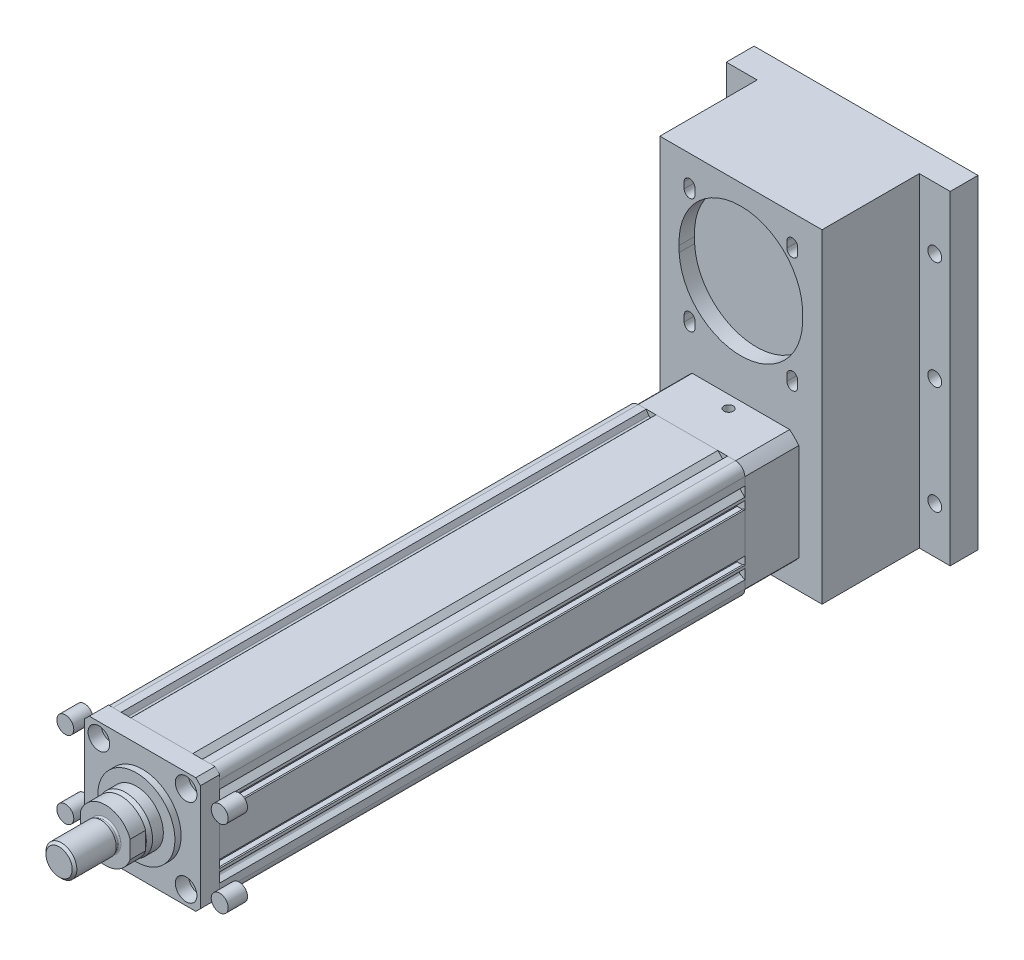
from build123d import *

# Parameters (mm, degrees)
SKETCH_1_R          = 31.5
SKETCH_1_R_2        = 3.35
EXTRUDE_1_DEPTH     = 340
SKETCH_2_R          = 5.5
EXTRUDE_1_2_DEPTH   = 12.5
EXTRUDE_1_2_2_DEPTH = 12.5
EXTRUDE_1_2_3_DEPTH = 12.5
EXTRUDE_1_2_4_DEPTH = 12.5
SKETCH_2_R_2        = 4.25
EXTRUDE_1_2_5_DEPTH = 12.5
SKETCH_3_R          = 7
SKETCH_3_R_2        = 4.25
CUT_EXTRUDE_1_DEPTH = 8.5
SKETCH_3_3_R        = 25
EXTRUDE_2_DEPTH     = 4
SKETCH_5_R          = 17.5
EXTRUDE_3_DEPTH     = 10
CHAMFER_1_SIZE      = 3
CHAMFER_1_SIZE2     = 1
EXTRUDE_4_DEPTH     = 10
SKETCH_8_R          = 9
EXTRUDE_5_DEPTH     = 3
SKETCH_9_R          = 10
EXTRUDE_6_DEPTH     = 27
CHAMFER_2_SIZE      = 1.5
FILLET_1_R          = 1
EXTRUDE_7_DEPTH     = 35
SKETCH_11_R         = 3
CUT_EXTRUDE_2_DEPTH = 5
SKETCH_18_W         = 105
SKETCH_18_H         = 210
EXTRUDE_11_DEPTH    = 63
CUT_EXTRUDE_7_DEPTH = 10
CUT_EXTRUDE_START   = -10
CUT_EXTRUDE_9_DEPTH = 5
SKETCH_23_W         = 145
SKETCH_23_H         = 210
SKETCH_23_R         = 4.5
EXTRUDE_12_DEPTH    = 18


with BuildPart() as part:
    # Sketch 1 → Extrude 1 (new body)
    with BuildSketch(Plane.XY):
        with BuildLine():
            Line((-31.5, 37.5), (-26.33, 37.5))
            Line((-26.33, 37.5), (-24.66467188, 34.615567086))
            ThreePointArc((-24.66467188, 34.615567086), (-23.929172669, 34.124122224), (-23.091539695, 34.408460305))
            Line((-23.091539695, 34.408460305), (-20, 37.5))
            Line((-20, 37.5), (20, 37.5))
            Line((20, 37.5), (23.091539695, 34.408460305))
            ThreePointArc((23.091539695, 34.408460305), (23.929172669, 34.124122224), (24.66467188, 34.615567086))
            Line((24.66467188, 34.615567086), (26.33, 37.5))
            Line((26.33, 37.5), (31.5, 37.5))
            ThreePointArc((31.5, 37.5), (35.742640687, 35.742640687), (37.5, 31.5))
            Line((37.5, 31.5), (37.5, 26.33))
            Line((37.5, 26.33), (34.615567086, 24.66467188))
            ThreePointArc((34.615567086, 24.66467188), (34.124122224, 23.929172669), (34.408460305, 23.091539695))
            Line((34.408460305, 23.091539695), (37.5, 20))
            Line((37.5, 20), (37.5, 18.1))
            Line((37.5, 18.1), (36.5, 18.1))
            Line((36.5, 18.1), (36.5, 18.7))
            Line((36.5, 18.7), (32.5, 18.7))
            Line((32.5, 18.7), (32.5, 12.4))
            Line((32.5, 12.4), (36.5, 12.4))
            Line((36.5, 12.4), (36.5, 13))
            Line((36.5, 13), (37.5, 13))
            Line((37.5, 13), (37.5, -13))
            Line((37.5, -13), (36.5, -13))
            Line((36.5, -13), (36.5, -12.4))
            Line((36.5, -12.4), (32.5, -12.4))
            Line((32.5, -12.4), (32.5, -18.7))
            Line((32.5, -18.7), (36.5, -18.7))
            Line((36.5, -18.7), (36.5, -18.1))
            Line((36.5, -18.1), (37.5, -18.1))
            Line((37.5, -18.1), (37.5, -20))
            Line((37.5, -20), (34.408460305, -23.091539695))
            ThreePointArc((34.408460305, -23.091539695), (34.124122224, -23.929172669), (34.615567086, -24.66467188))
            Line((34.615567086, -24.66467188), (37.5, -26.33))
            Line((37.5, -26.33), (37.5, -31.5))
            ThreePointArc((37.5, -31.5), (35.742640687, -35.742640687), (31.5, -37.5))
            Line((31.5, -37.5), (26.33, -37.5))
            Line((26.33, -37.5), (24.66467188, -34.615567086))
            ThreePointArc((24.66467188, -34.615567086), (23.929172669, -34.124122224), (23.091539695, -34.408460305))
            Line((23.091539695, -34.408460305), (20, -37.5))
            Line((20, -37.5), (18.1, -37.5))
            Line((18.1, -37.5), (18.1, -36.5))
            Line((18.1, -36.5), (18.7, -36.5))
            Line((18.7, -36.5), (18.7, -33.945032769))
            Line((18.7, -33.945032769), (12.4, -33.945032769))
            Line((12.4, -33.945032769), (12.4, -36.5))
            Line((12.4, -36.5), (13, -36.5))
            Line((13, -36.5), (13, -37.5))
            Line((13, -37.5), (-13, -37.5))
            Line((-13, -37.5), (-13, -36.5))
            Line((-13, -36.5), (-12.4, -36.5))
            Line((-12.4, -36.5), (-12.4, -33.945032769))
            Line((-12.4, -33.945032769), (-18.7, -33.945032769))
            Line((-18.7, -33.945032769), (-18.7, -36.5))
            Line((-18.7, -36.5), (-18.1, -36.5))
            Line((-18.1, -36.5), (-18.1, -37.5))
            Line((-18.1, -37.5), (-20, -37.5))
            Line((-20, -37.5), (-23.091539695, -34.408460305))
            ThreePointArc((-23.091539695, -34.408460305), (-23.929172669, -34.124122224), (-24.66467188, -34.615567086))
            Line((-24.66467188, -34.615567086), (-26.33, -37.5))
            Line((-26.33, -37.5), (-31.5, -37.5))
            ThreePointArc((-31.5, -37.5), (-35.742640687, -35.742640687), (-37.5, -31.5))
            Line((-37.5, -31.5), (-37.5, -26.33))
            Line((-37.5, -26.33), (-34.615567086, -24.66467188))
            ThreePointArc((-34.615567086, -24.66467188), (-34.124122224, -23.929172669), (-34.408460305, -23.091539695))
            Line((-34.408460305, -23.091539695), (-37.5, -20))
            Line((-37.5, -20), (-37.5, -18.1))
            Line((-37.5, -18.1), (-36.5, -18.1))
            Line((-36.5, -18.1), (-36.5, -18.7))
            Line((-36.5, -18.7), (-32.5, -18.7))
            Line((-32.5, -18.7), (-32.5, -12.4))
            Line((-32.5, -12.4), (-36.5, -12.4))
            Line((-36.5, -12.4), (-36.5, -13))
            Line((-36.5, -13), (-37.5, -13))
            Line((-37.5, -13), (-37.5, 13))
            Line((-37.5, 13), (-36.5, 13))
            Line((-36.5, 13), (-36.5, 12.4))
            Line((-36.5, 12.4), (-32.5, 12.4))
            Line((-32.5, 12.4), (-32.5, 18.7))
            Line((-32.5, 18.7), (-36.5, 18.7))
            Line((-36.5, 18.7), (-36.5, 18.1))
            Line((-36.5, 18.1), (-37.5, 18.1))
            Line((-37.5, 18.1), (-37.5, 20))
            Line((-37.5, 20), (-34.408460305, 23.091539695))
            ThreePointArc((-34.408460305, 23.091539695), (-34.124122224, 23.929172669), (-34.615567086, 24.66467188))
            Line((-34.615567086, 24.66467188), (-37.5, 26.33))
            Line((-37.5, 26.33), (-37.5, 31.5))
            ThreePointArc((-37.5, 31.5), (-35.742640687, 35.742640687), (-31.5, 37.5))
        make_face()
        Circle(SKETCH_1_R, mode=Mode.SUBTRACT)
        with Locations((-28.25, 28.25)):
            Circle(SKETCH_1_R_2, mode=Mode.SUBTRACT)
        with Locations(Location((28.25, 28.25, 0), (0, 0, 180))):
            Circle(SKETCH_1_R_2, mode=Mode.SUBTRACT)
        with Locations((28.25, -28.25)):
            Circle(SKETCH_1_R_2, mode=Mode.SUBTRACT)
        with Locations(Location((-28.25, -28.25, 0), (0, 0, 180))):
            Circle(SKETCH_1_R_2, mode=Mode.SUBTRACT)
    extrude(amount=EXTRUDE_1_DEPTH)


with BuildPart() as body_2:
    # Sketch 2 → Extrude 1 2 (new body)
    with BuildSketch(Plane.XY.offset(340)):
        with Locations((-50, 25)):
            Circle(SKETCH_2_R)
    extrude(amount=EXTRUDE_1_2_DEPTH)


with BuildPart() as body_3:
    # Sketch 2 → Extrude 1 2 2 (new body)
    with BuildSketch(Plane.XY.offset(340)):
        with Locations(Location((50, 25, 0), (0, 0, 180))):
            Circle(SKETCH_2_R)
    extrude(amount=EXTRUDE_1_2_2_DEPTH)


with BuildPart() as body_4:
    # Sketch 2 → Extrude 1 2 3 (new body)
    with BuildSketch(Plane.XY.offset(340)):
        with Locations(Location((-50, -25, 0), (0, 0, 180))):
            Circle(SKETCH_2_R)
    extrude(amount=EXTRUDE_1_2_3_DEPTH)


with BuildPart() as body_5:
    # Sketch 2 → Extrude 1 2 4 (new body)
    with BuildSketch(Plane.XY.offset(340)):
        with Locations((50, -25)):
            Circle(SKETCH_2_R)
    extrude(amount=EXTRUDE_1_2_4_DEPTH)


with BuildPart() as body_6:
    # Sketch 2 → Extrude 1 2 5 (new body)
    with BuildSketch(Plane.XY.offset(340)):
        Polygon((-37.5, 34.5), (-34.5, 37.5), (34.5, 37.5), (37.5, 34.5), (37.5, -34.5), (34.5, -37.5), (-34.5, -37.5), (-37.5, -34.5), align=None)
        with Locations((-28.25, 28.25)):
            Circle(SKETCH_2_R_2, mode=Mode.SUBTRACT)
        with Locations(Location((28.25, 28.25, 0), (0, 0, 180))):
            Circle(SKETCH_2_R_2, mode=Mode.SUBTRACT)
        with Locations(Location((-28.25, -28.25, 0), (0, 0, 180))):
            Circle(SKETCH_2_R_2, mode=Mode.SUBTRACT)
        with Locations((28.25, -28.25)):
            Circle(SKETCH_2_R_2, mode=Mode.SUBTRACT)
    extrude(amount=EXTRUDE_1_2_5_DEPTH)

    # Sketch 3 → Cut-Extrude 1 (cut)
    # profile 1 of 4: a face of its own
    with BuildSketch(Plane.XY.offset(352.5)):
        with Locations((28.25, -28.25)):
            Circle(SKETCH_3_R)
        with Locations((28.25, -28.25)):
            Circle(SKETCH_3_R_2, mode=Mode.SUBTRACT)
    # profile 2 of 4: a face of its own
    with BuildSketch(Plane.XY.offset(352.5)):
        with Locations((-28.25, -28.25)):
            Circle(SKETCH_3_R)
        with Locations(Location((-28.25, -28.25, 0), (0, 0, 180))):
            Circle(SKETCH_3_R_2, mode=Mode.SUBTRACT)
    # profile 3 of 4: a face of its own
    with BuildSketch(Plane.XY.offset(352.5)):
        with Locations((-28.25, 28.25)):
            Circle(SKETCH_3_R)
    # profile 4 of 4: a face of its own
    with BuildSketch(Plane.XY.offset(352.5)):
        with Locations((28.25, 28.25)):
            Circle(SKETCH_3_R)
    extrude(amount=-CUT_EXTRUDE_1_DEPTH, mode=Mode.SUBTRACT)

    # Sketch 3_3 → Extrude 2 (add)
    with BuildSketch(Plane.XY.offset(352.5)):
        Circle(SKETCH_3_3_R)
    extrude(amount=EXTRUDE_2_DEPTH)

    # Sketch 5 → Extrude 3 (add)
    with BuildSketch(Plane.XY.offset(356.5)):
        Circle(SKETCH_5_R)
    extrude(amount=EXTRUDE_3_DEPTH)

    # Chamfer 1
    chamfer_1_edges = [body_6.edges().sort_by_distance(p)[0] for p in [
        (-17.5, 0, 366.5),
    ]]
    chamfer_1_side = [body_6.faces().sort_by_distance(p)[0] for p in [
        (-17.5, 0, 361.5),
    ]]
    chamfer(chamfer_1_edges, length=CHAMFER_1_SIZE, length2=CHAMFER_1_SIZE2, reference=chamfer_1_side[0])

    # Sketch 6 → Extrude 4 (add)
    with BuildSketch(Plane.XY.offset(366.5)):
        with BuildLine():
            Line((-16, 5.744562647), (-16, -5.744562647))
            ThreePointArc((-16, -5.744562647), (0, -17), (16, -5.744562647))
            Line((16, -5.744562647), (16, 5.744562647))
            ThreePointArc((16, 5.744562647), (0, 17), (-16, 5.744562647))
        make_face()
    extrude(amount=EXTRUDE_4_DEPTH)

    # Sketch 8 → Extrude 5 (add)
    with BuildSketch(Plane.XY.offset(376.5)):
        Circle(SKETCH_8_R)
    extrude(amount=EXTRUDE_5_DEPTH)

    # Sketch 9 → Extrude 6 (add)
    with BuildSketch(Plane.XY.offset(379.5)):
        Circle(SKETCH_9_R)
    extrude(amount=EXTRUDE_6_DEPTH)

    # Chamfer 2
    chamfer_2_edges = [body_6.edges().sort_by_distance(p)[0] for p in [
        (-10, 0, 406.5),
    ]]
    chamfer(chamfer_2_edges, length=CHAMFER_2_SIZE)

    # Fillet 1
    fillet_1_edges = [body_6.edges().sort_by_distance(p)[0] for p in [
        (-9, 0, 376.5),
    ]]
    fillet(fillet_1_edges, radius=FILLET_1_R)


with BuildPart() as body_7:
    # Sketch 10 → Extrude 7 (new body)
    with BuildSketch(Plane(origin=(0, 0, 0), x_dir=(-1, 0, 0), z_dir=(0, 0, -1))):
        with BuildLine():
            Line((-31.539657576, 37.5), (31.539657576, 37.5))
            ThreePointArc((31.539657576, 37.5), (34.648232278, 34.648232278), (37.5, 31.539657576))
            Line((37.5, 31.539657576), (37.5, -31.539657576))
            ThreePointArc((37.5, -31.539657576), (34.648232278, -34.648232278), (31.539657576, -37.5))
            Line((31.539657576, -37.5), (-31.539657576, -37.5))
            ThreePointArc((-31.539657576, -37.5), (-34.648232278, -34.648232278), (-37.5, -31.539657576))
            Line((-37.5, -31.539657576), (-37.5, 31.539657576))
            ThreePointArc((-37.5, 31.539657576), (-34.648232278, 34.648232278), (-31.539657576, 37.5))
        make_face()
    extrude(amount=EXTRUDE_7_DEPTH)

    # Sketch 11 → Cut-Extrude 2 (cut)
    with BuildSketch(Plane(origin=(0, 37.5, 0), x_dir=(1, 0, 0), z_dir=(0, 1, 0))):
        with Locations(Location((0, 27, 0), (0, 0, 270))):
            Circle(SKETCH_11_R)
    extrude(amount=-CUT_EXTRUDE_2_DEPTH, mode=Mode.SUBTRACT)

    # Sketch 18 → Extrude 11 (add)
    with BuildSketch(Plane(origin=(0, 0, -35), x_dir=(-1, 0, 0), z_dir=(0, 0, -1))):
        with Locations((0, 55)):
            Rectangle(SKETCH_18_W, SKETCH_18_H)
    extrude(amount=EXTRUDE_11_DEPTH)

    # Sketch 19 → Cut-Extrude 7 (cut)
    with BuildSketch(Plane.XY.offset(-35)):
        with BuildLine():
            Line((-40, 105), (-40, 101))
            ThreePointArc((-40, 101), (-0.049906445, 62.997504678), (39.90018711, 101))
            Line((39.90018711, 101), (39.90018711, 105))
            ThreePointArc((39.90018711, 105), (-0.049906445, 146.997504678), (-40, 105))
        make_face()
        with BuildLine():
            Line((-36.761032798, 138.332341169), (-36.761032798, 142.332341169))
            ThreePointArc((-36.761032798, 142.332341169), (-33.261032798, 145.832341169), (-29.761032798, 142.332341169))
            Line((-29.761032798, 142.332341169), (-29.761032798, 138.332341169))
            ThreePointArc((-29.761032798, 138.332341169), (-33.261032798, 134.832341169), (-36.761032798, 138.332341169))
        make_face()
        with BuildLine():
            Line((36.761032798, 138.332341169), (36.761032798, 142.332341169))
            ThreePointArc((36.761032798, 142.332341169), (33.261032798, 145.832341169), (29.761032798, 142.332341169))
            Line((29.761032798, 142.332341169), (29.761032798, 138.332341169))
            ThreePointArc((29.761032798, 138.332341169), (33.261032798, 134.832341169), (36.761032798, 138.332341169))
        make_face()
        with BuildLine():
            Line((36.761032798, 67.667658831), (36.761032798, 63.667658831))
            ThreePointArc((36.761032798, 63.667658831), (33.261032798, 60.167658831), (29.761032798, 63.667658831))
            Line((29.761032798, 63.667658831), (29.761032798, 67.667658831))
            ThreePointArc((29.761032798, 67.667658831), (33.261032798, 71.167658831), (36.761032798, 67.667658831))
        make_face()
        with BuildLine():
            Line((-36.761032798, 67.667658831), (-36.761032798, 63.667658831))
            ThreePointArc((-36.761032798, 63.667658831), (-33.261032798, 60.167658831), (-29.761032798, 63.667658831))
            Line((-29.761032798, 63.667658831), (-29.761032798, 67.667658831))
            ThreePointArc((-29.761032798, 67.667658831), (-33.261032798, 71.167658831), (-36.761032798, 67.667658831))
        make_face()
    extrude(amount=-CUT_EXTRUDE_7_DEPTH, mode=Mode.SUBTRACT)

    # Sketch 19_3 → Cut-Extrude 9 (cut)
    with BuildSketch(Plane.XY.offset(-35).offset(CUT_EXTRUDE_START)):
        with BuildLine():
            Line((-38.461032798, 138.282341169), (-38.461032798, 142.382341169))
            ThreePointArc((-38.461032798, 142.382341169), (-33.261032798, 147.582341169), (-28.061032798, 142.382341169))
            Line((-28.061032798, 142.382341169), (-28.061032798, 138.282341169))
            ThreePointArc((-28.061032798, 138.282341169), (-33.261032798, 133.082341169), (-38.461032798, 138.282341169))
        make_face()
        with BuildLine():
            Line((38.461032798, 138.282341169), (38.461032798, 142.382341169))
            ThreePointArc((38.461032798, 142.382341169), (33.261032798, 147.582341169), (28.061032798, 142.382341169))
            Line((28.061032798, 142.382341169), (28.061032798, 138.282341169))
            ThreePointArc((28.061032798, 138.282341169), (33.261032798, 133.082341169), (38.461032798, 138.282341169))
        make_face()
        with BuildLine():
            Line((38.461032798, 67.717658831), (38.461032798, 63.617658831))
            ThreePointArc((38.461032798, 63.617658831), (33.261032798, 58.417658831), (28.061032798, 63.617658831))
            Line((28.061032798, 63.617658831), (28.061032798, 67.717658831))
            ThreePointArc((28.061032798, 67.717658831), (33.261032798, 72.917658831), (38.461032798, 67.717658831))
        make_face()
        with BuildLine():
            Line((-38.461032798, 67.717658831), (-38.461032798, 63.617658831))
            ThreePointArc((-38.461032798, 63.617658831), (-33.261032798, 58.417658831), (-28.061032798, 63.617658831))
            Line((-28.061032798, 63.617658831), (-28.061032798, 67.717658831))
            ThreePointArc((-28.061032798, 67.717658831), (-33.261032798, 72.917658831), (-38.461032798, 67.717658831))
        make_face()
    extrude(amount=-CUT_EXTRUDE_9_DEPTH, mode=Mode.SUBTRACT)

    # Sketch 23 → Extrude 12 (add)
    with BuildSketch(Plane(origin=(0, 0, -98), x_dir=(-1, 0, 0), z_dir=(0, 0, -1))):
        with Locations((0, 55)):
            Rectangle(SKETCH_23_W, SKETCH_23_H)
        with Locations((-62.5, -20)):
            Circle(SKETCH_23_R, mode=Mode.SUBTRACT)
        with Locations((-62.5, 50)):
            Circle(SKETCH_23_R, mode=Mode.SUBTRACT)
        with Locations((-62.5, 120)):
            Circle(SKETCH_23_R, mode=Mode.SUBTRACT)
        with Locations(Location((62.5, -20, 0), (0, 0, 180))):
            Circle(SKETCH_23_R, mode=Mode.SUBTRACT)
        with Locations(Location((62.5, 50, 0), (0, 0, 180))):
            Circle(SKETCH_23_R, mode=Mode.SUBTRACT)
        with Locations(Location((62.5, 120, 0), (0, 0, 180))):
            Circle(SKETCH_23_R, mode=Mode.SUBTRACT)
    extrude(amount=EXTRUDE_12_DEPTH)


solid = Compound([part.part, body_2.part, body_3.part, body_4.part, body_5.part, body_6.part, body_7.part])
